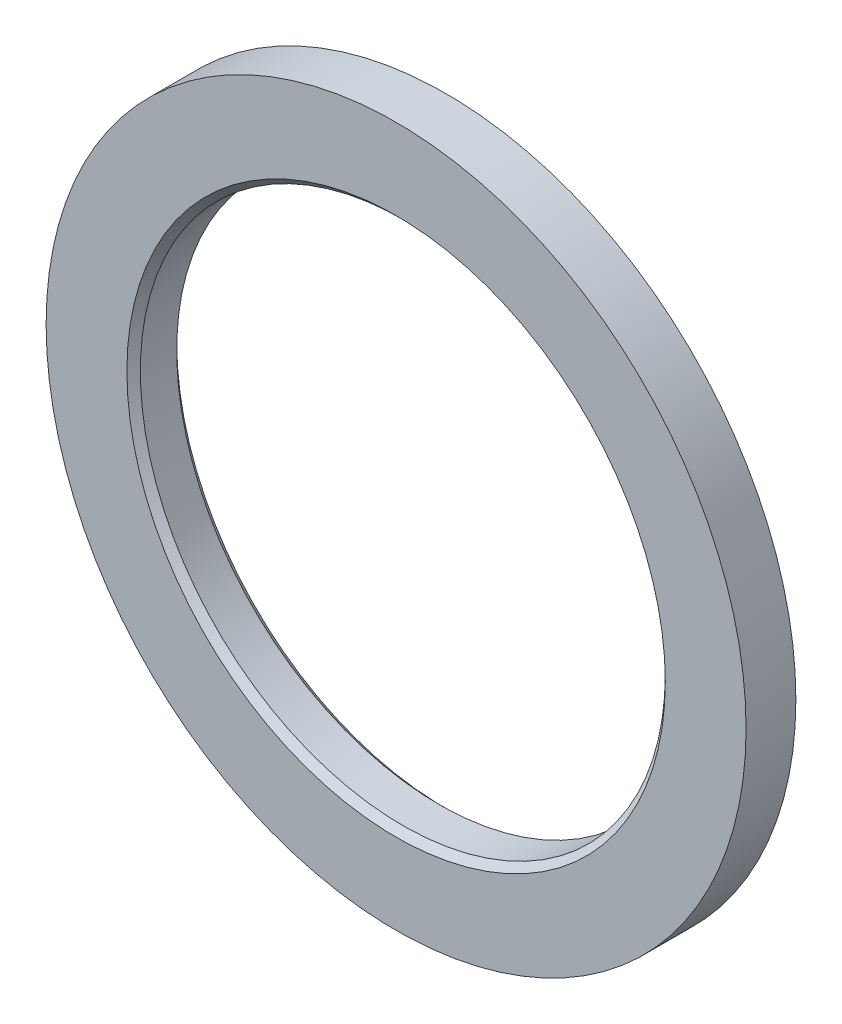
from build123d import *

# Parameters (mm, degrees)
ESQUISSE1_R          = 26
ESQUISSE1_R_2        = 19.5
BASE_EXTRUSION_DEPTH = 3.7
CHANFREIN1_SIZE      = 0.5


with BuildPart() as part:
    # Esquisse1 → Base-Extrusion (new body)
    with BuildSketch(Plane.XY):
        Circle(ESQUISSE1_R)
        Circle(ESQUISSE1_R_2, mode=Mode.SUBTRACT)
    extrude(amount=BASE_EXTRUSION_DEPTH)

    # Chanfrein1
    chanfrein1_edges = [part.edges().sort_by_distance(p)[0] for p in [
        (-19.5, 0, 0),
        (-19.5, 0, 3.7),
    ]]
    chamfer(chanfrein1_edges, length=CHANFREIN1_SIZE)


solid = part.part
